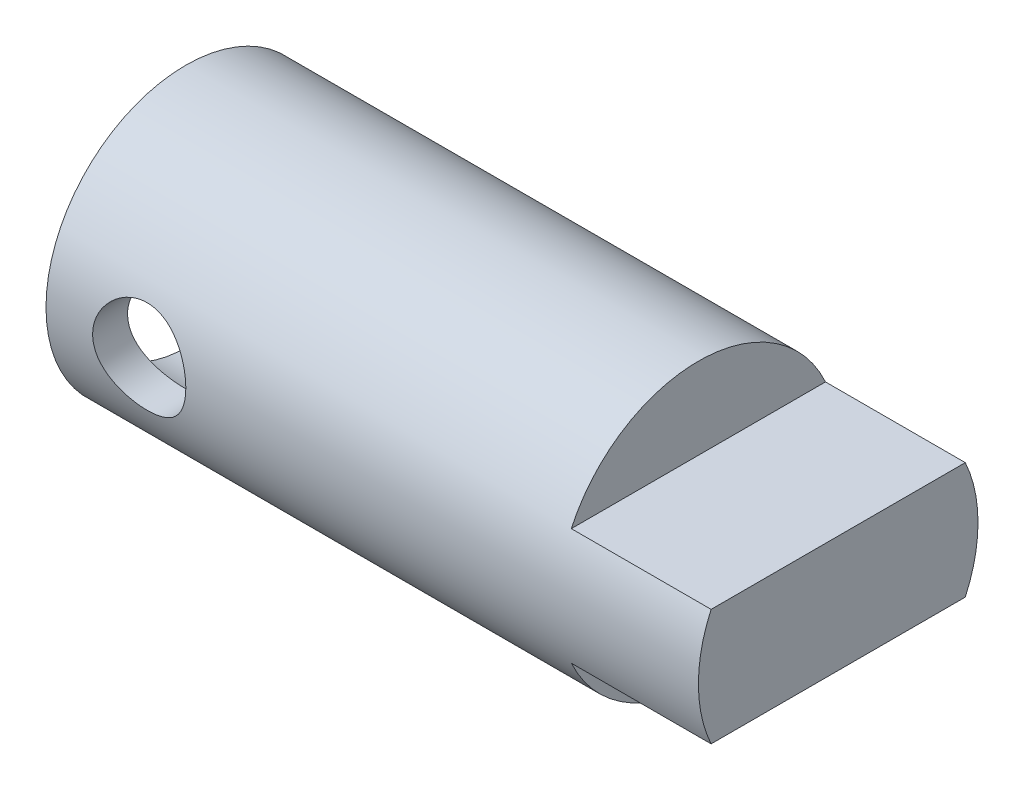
from build123d import *

# Parameters (mm, degrees)
ESQUISSE2_W             = 7.177687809
ESQUISSE2_H             = 5.79397211
ENL_V_MAT_EXTRU_1_DEPTH = 15
ESQUISSE3_R             = 2
ENL_V_MAT_EXTRU_2_DEPTH = 15


with BuildPart() as part:
    # Esquisse1 → Base-R_volution (revolve)
    with BuildSketch(Plane.XY, mode=Mode.PRIVATE) as base_r_volution_sk:
        Polygon((0, 4.5), (-14, 4.5), (-14, 6), (14, 6), (14, 0), (1.611579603, 0), align=None)
    revolve(base_r_volution_sk.sketch.rotate(Axis((-58.255465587, 0, 0), (1, 0, 0)), 90), axis=Axis((-58.255465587, 0, 0), (1, 0, 0)))

    # Esquisse2 → Enl_v. mat.-Extru.1 (cut, symmetric)
    with BuildSketch(Plane.XY):
        with Locations((11.588843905, 5.396986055)):
            Rectangle(ESQUISSE2_W, ESQUISSE2_H)
        with Locations((11.588843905, -5.396986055)):
            Rectangle(ESQUISSE2_W, ESQUISSE2_H)
    extrude(amount=ENL_V_MAT_EXTRU_1_DEPTH, both=True, mode=Mode.SUBTRACT)

    # Esquisse3 → Enl_v. mat.-Extru.2 (cut, symmetric)
    with BuildSketch(Plane.XY):
        with Locations((-10, 0)):
            Circle(ESQUISSE3_R)
    extrude(amount=ENL_V_MAT_EXTRU_2_DEPTH, both=True, mode=Mode.SUBTRACT)


solid = part.part
